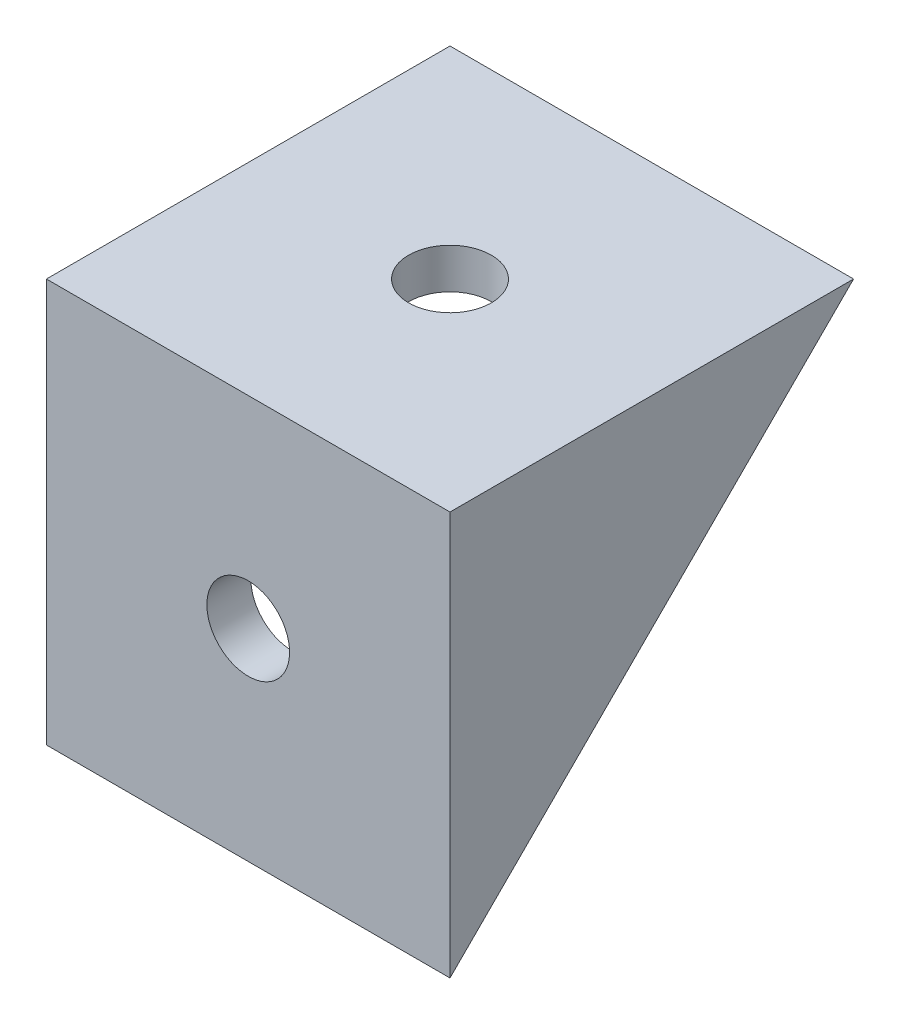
ISO-10303-21;
HEADER;
FILE_DESCRIPTION(('STEP AP214'),'2;1');
FILE_NAME('part.step','',(''),(''),'','','');
FILE_SCHEMA(('AUTOMOTIVE_DESIGN { 1 0 10303 214 1 1 1 1 }'));
ENDSEC;
DATA;
#1=APPLICATION_CONTEXT('core data for automotive mechanical design processes');
#2=APPLICATION_PROTOCOL_DEFINITION('international standard','automotive_design',2000,#1);
#3=PRODUCT_CONTEXT('',#1,'mechanical');
#4=PRODUCT('Part','Part','',(#3));
#5=PRODUCT_RELATED_PRODUCT_CATEGORY('part','',(#4));
#6=PRODUCT_DEFINITION_FORMATION('','',#4);
#7=PRODUCT_DEFINITION_CONTEXT('part definition',#1,'design');
#8=PRODUCT_DEFINITION('design','',#6,#7);
#9=PRODUCT_DEFINITION_SHAPE('','',#8);
#10=(LENGTH_UNIT() NAMED_UNIT(*) SI_UNIT(.MILLI.,.METRE.));
#11=(NAMED_UNIT(*) PLANE_ANGLE_UNIT() SI_UNIT($,.RADIAN.));
#12=(NAMED_UNIT(*) SI_UNIT($,.STERADIAN.) SOLID_ANGLE_UNIT());
#13=UNCERTAINTY_MEASURE_WITH_UNIT(LENGTH_MEASURE(1.E-05),#10,'distance_accuracy_value','');
#14=(GEOMETRIC_REPRESENTATION_CONTEXT(3) GLOBAL_UNCERTAINTY_ASSIGNED_CONTEXT((#13)) GLOBAL_UNIT_ASSIGNED_CONTEXT((#10,
#11,#12)) REPRESENTATION_CONTEXT('',''));
#15=CARTESIAN_POINT('',(0.,0.,0.));
#16=DIRECTION('',(0.,0.,1.));
#17=DIRECTION('',(1.,0.,0.));
#18=AXIS2_PLACEMENT_3D('',#15,#16,#17);
#19=CARTESIAN_POINT('',(20.,0.,-40.));
#20=DIRECTION('',(0.,0.707106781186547,0.707106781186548));
#21=DIRECTION('',(0.,-0.707106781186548,0.707106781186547));
#22=AXIS2_PLACEMENT_3D('',#19,#20,#21);
#23=PLANE('',#22);
#24=DIRECTION('',(0.,0.707106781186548,-0.707106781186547));
#25=VECTOR('',#24,1.);
#26=CARTESIAN_POINT('',(-20.,0.,-40.));
#27=LINE('',#26,#25);
#28=CARTESIAN_POINT('',(-20.,-40.,0.));
#29=VERTEX_POINT('',#28);
#30=CARTESIAN_POINT('',(-20.,0.,-40.));
#31=VERTEX_POINT('',#30);
#32=EDGE_CURVE('E130',#29,#31,#27,.T.);
#33=ORIENTED_EDGE('',*,*,#32,.T.);
#34=DIRECTION('',(-1.,0.,0.));
#35=VECTOR('',#34,1.);
#36=CARTESIAN_POINT('',(20.,0.,-40.));
#37=LINE('',#36,#35);
#38=CARTESIAN_POINT('',(20.,0.,-40.));
#39=VERTEX_POINT('',#38);
#40=EDGE_CURVE('E134',#39,#31,#37,.T.);
#41=ORIENTED_EDGE('',*,*,#40,.F.);
#42=DIRECTION('',(0.,0.707106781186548,-0.707106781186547));
#43=VECTOR('',#42,1.);
#44=CARTESIAN_POINT('',(20.,0.,-40.));
#45=LINE('',#44,#43);
#46=CARTESIAN_POINT('',(20.,-40.,0.));
#47=VERTEX_POINT('',#46);
#48=EDGE_CURVE('E82',#47,#39,#45,.T.);
#49=ORIENTED_EDGE('',*,*,#48,.F.);
#50=DIRECTION('',(-1.,0.,0.));
#51=VECTOR('',#50,1.);
#52=CARTESIAN_POINT('',(20.,-40.,0.));
#53=LINE('',#52,#51);
#54=EDGE_CURVE('E136',#47,#29,#53,.T.);
#55=ORIENTED_EDGE('',*,*,#54,.T.);
#56=EDGE_LOOP('',(#33,#41,#49,#55));
#57=FACE_BOUND('',#56,.T.);
#58=DIRECTION('',(0.,0.707106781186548,-0.707106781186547));
#59=VECTOR('',#58,1.);
#60=CARTESIAN_POINT('',(-15.,0.,-40.));
#61=LINE('',#60,#59);
#62=CARTESIAN_POINT('',(-15.,-35.6369103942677,-4.36308960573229));
#63=VERTEX_POINT('',#62);
#64=CARTESIAN_POINT('',(-15.,-4.,-36.));
#65=VERTEX_POINT('',#64);
#66=EDGE_CURVE('E11',#63,#65,#61,.T.);
#67=ORIENTED_EDGE('',*,*,#66,.F.);
#68=DIRECTION('',(1.,0.,0.));
#69=VECTOR('',#68,1.);
#70=CARTESIAN_POINT('',(20.,-35.6369103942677,-4.36308960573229));
#71=LINE('',#70,#69);
#72=CARTESIAN_POINT('',(15.,-35.6369103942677,-4.36308960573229));
#73=VERTEX_POINT('',#72);
#74=EDGE_CURVE('E43',#63,#73,#71,.T.);
#75=ORIENTED_EDGE('',*,*,#74,.T.);
#76=DIRECTION('',(0.,0.707106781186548,-0.707106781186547));
#77=VECTOR('',#76,1.);
#78=CARTESIAN_POINT('',(15.,0.,-40.));
#79=LINE('',#78,#77);
#80=CARTESIAN_POINT('',(15.,-4.,-36.));
#81=VERTEX_POINT('',#80);
#82=EDGE_CURVE('E138',#73,#81,#79,.T.);
#83=ORIENTED_EDGE('',*,*,#82,.T.);
#84=DIRECTION('',(-1.,0.,0.));
#85=VECTOR('',#84,1.);
#86=CARTESIAN_POINT('',(20.,-4.,-36.));
#87=LINE('',#86,#85);
#88=EDGE_CURVE('E141',#81,#65,#87,.T.);
#89=ORIENTED_EDGE('',*,*,#88,.T.);
#90=EDGE_LOOP('',(#67,#75,#83,#89));
#91=FACE_BOUND('',#90,.T.);
#92=ADVANCED_FACE('F35',(#57,#91),#23,.F.);
#93=CARTESIAN_POINT('',(20.,0.,0.));
#94=DIRECTION('',(0.,0.,-1.));
#95=DIRECTION('',(0.,1.,0.));
#96=AXIS2_PLACEMENT_3D('',#93,#94,#95);
#97=PLANE('',#96);
#98=CARTESIAN_POINT('',(0.,-20.,0.));
#99=DIRECTION('',(0.,0.,-1.));
#100=DIRECTION('',(0.,1.,0.));
#101=AXIS2_PLACEMENT_3D('',#98,#99,#100);
#102=CIRCLE('',#101,4.1);
#103=CARTESIAN_POINT('',(0.,-15.9,0.));
#104=VERTEX_POINT('',#103);
#105=EDGE_CURVE('E119',#104,#104,#102,.T.);
#106=ORIENTED_EDGE('',*,*,#105,.T.);
#107=EDGE_LOOP('',(#106));
#108=FACE_BOUND('',#107,.T.);
#109=DIRECTION('',(0.,-1.,0.));
#110=VECTOR('',#109,1.);
#111=CARTESIAN_POINT('',(-20.,0.,0.));
#112=LINE('',#111,#110);
#113=CARTESIAN_POINT('',(-20.,0.,0.));
#114=VERTEX_POINT('',#113);
#115=EDGE_CURVE('E111',#114,#29,#112,.T.);
#116=ORIENTED_EDGE('',*,*,#115,.T.);
#117=ORIENTED_EDGE('',*,*,#54,.F.);
#118=DIRECTION('',(0.,-1.,0.));
#119=VECTOR('',#118,1.);
#120=CARTESIAN_POINT('',(20.,0.,0.));
#121=LINE('',#120,#119);
#122=CARTESIAN_POINT('',(20.,0.,0.));
#123=VERTEX_POINT('',#122);
#124=EDGE_CURVE('E123',#123,#47,#121,.T.);
#125=ORIENTED_EDGE('',*,*,#124,.F.);
#126=DIRECTION('',(-1.,0.,0.));
#127=VECTOR('',#126,1.);
#128=CARTESIAN_POINT('',(20.,0.,0.));
#129=LINE('',#128,#127);
#130=EDGE_CURVE('E127',#123,#114,#129,.T.);
#131=ORIENTED_EDGE('',*,*,#130,.T.);
#132=EDGE_LOOP('',(#116,#117,#125,#131));
#133=FACE_BOUND('',#132,.T.);
#134=ADVANCED_FACE('F37',(#108,#133),#97,.F.);
#135=CARTESIAN_POINT('',(20.,0.,0.));
#136=DIRECTION('',(0.,-1.,0.));
#137=DIRECTION('',(0.,0.,-1.));
#138=AXIS2_PLACEMENT_3D('',#135,#136,#137);
#139=PLANE('',#138);
#140=CARTESIAN_POINT('',(0.,0.,-20.));
#141=DIRECTION('',(0.,-1.,0.));
#142=DIRECTION('',(0.,0.,-1.));
#143=AXIS2_PLACEMENT_3D('',#140,#141,#142);
#144=CIRCLE('',#143,4.1);
#145=CARTESIAN_POINT('',(0.,0.,-24.1));
#146=VERTEX_POINT('',#145);
#147=EDGE_CURVE('E183',#146,#146,#144,.T.);
#148=ORIENTED_EDGE('',*,*,#147,.T.);
#149=EDGE_LOOP('',(#148));
#150=FACE_BOUND('',#149,.T.);
#151=DIRECTION('',(0.,0.,1.));
#152=VECTOR('',#151,1.);
#153=CARTESIAN_POINT('',(-20.,0.,0.));
#154=LINE('',#153,#152);
#155=EDGE_CURVE('E76',#31,#114,#154,.T.);
#156=ORIENTED_EDGE('',*,*,#155,.T.);
#157=ORIENTED_EDGE('',*,*,#130,.F.);
#158=DIRECTION('',(0.,0.,1.));
#159=VECTOR('',#158,1.);
#160=CARTESIAN_POINT('',(20.,0.,0.));
#161=LINE('',#160,#159);
#162=EDGE_CURVE('E59',#39,#123,#161,.T.);
#163=ORIENTED_EDGE('',*,*,#162,.F.);
#164=ORIENTED_EDGE('',*,*,#40,.T.);
#165=EDGE_LOOP('',(#156,#157,#163,#164));
#166=FACE_BOUND('',#165,.T.);
#167=ADVANCED_FACE('F160',(#150,#166),#139,.F.);
#168=CARTESIAN_POINT('',(20.,0.,0.));
#169=DIRECTION('',(1.,0.,0.));
#170=DIRECTION('',(0.,0.,-1.));
#171=AXIS2_PLACEMENT_3D('',#168,#169,#170);
#172=PLANE('',#171);
#173=ORIENTED_EDGE('',*,*,#124,.T.);
#174=ORIENTED_EDGE('',*,*,#48,.T.);
#175=ORIENTED_EDGE('',*,*,#162,.T.);
#176=EDGE_LOOP('',(#173,#174,#175));
#177=FACE_BOUND('',#176,.T.);
#178=ADVANCED_FACE('F165',(#177),#172,.T.);
#179=CARTESIAN_POINT('',(-20.,0.,0.));
#180=DIRECTION('',(1.,0.,0.));
#181=DIRECTION('',(0.,0.,-1.));
#182=AXIS2_PLACEMENT_3D('',#179,#180,#181);
#183=PLANE('',#182);
#184=ORIENTED_EDGE('',*,*,#115,.F.);
#185=ORIENTED_EDGE('',*,*,#155,.F.);
#186=ORIENTED_EDGE('',*,*,#32,.F.);
#187=EDGE_LOOP('',(#184,#185,#186));
#188=FACE_BOUND('',#187,.T.);
#189=ADVANCED_FACE('F167',(#188),#183,.F.);
#190=CARTESIAN_POINT('',(-15.,-4.,-4.36308960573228));
#191=DIRECTION('',(0.,0.,1.));
#192=DIRECTION('',(0.,-1.,0.));
#193=AXIS2_PLACEMENT_3D('',#190,#191,#192);
#194=PLANE('',#193);
#195=CARTESIAN_POINT('',(0.,-20.,-4.36308960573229));
#196=DIRECTION('',(0.,0.,-1.));
#197=DIRECTION('',(0.,1.,0.));
#198=AXIS2_PLACEMENT_3D('',#195,#196,#197);
#199=CIRCLE('',#198,4.1);
#200=CARTESIAN_POINT('',(0.,-15.9,-4.36308960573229));
#201=VERTEX_POINT('',#200);
#202=EDGE_CURVE('E186',#201,#201,#199,.T.);
#203=ORIENTED_EDGE('',*,*,#202,.F.);
#204=EDGE_LOOP('',(#203));
#205=FACE_BOUND('',#204,.T.);
#206=DIRECTION('',(0.,-1.,0.));
#207=VECTOR('',#206,1.);
#208=CARTESIAN_POINT('',(-15.,-4.,-4.36308960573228));
#209=LINE('',#208,#207);
#210=CARTESIAN_POINT('',(-15.,-4.,-4.36308960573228));
#211=VERTEX_POINT('',#210);
#212=EDGE_CURVE('E101',#211,#63,#209,.T.);
#213=ORIENTED_EDGE('',*,*,#212,.F.);
#214=DIRECTION('',(1.,0.,0.));
#215=VECTOR('',#214,1.);
#216=CARTESIAN_POINT('',(-15.,-4.,-4.36308960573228));
#217=LINE('',#216,#215);
#218=CARTESIAN_POINT('',(15.,-4.,-4.36308960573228));
#219=VERTEX_POINT('',#218);
#220=EDGE_CURVE('E105',#211,#219,#217,.T.);
#221=ORIENTED_EDGE('',*,*,#220,.T.);
#222=DIRECTION('',(0.,-1.,0.));
#223=VECTOR('',#222,1.);
#224=CARTESIAN_POINT('',(15.,-4.,-4.36308960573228));
#225=LINE('',#224,#223);
#226=EDGE_CURVE('E116',#219,#73,#225,.T.);
#227=ORIENTED_EDGE('',*,*,#226,.T.);
#228=ORIENTED_EDGE('',*,*,#74,.F.);
#229=EDGE_LOOP('',(#213,#221,#227,#228));
#230=FACE_BOUND('',#229,.T.);
#231=ADVANCED_FACE('F113',(#205,#230),#194,.F.);
#232=CARTESIAN_POINT('',(-15.,-4.,-4.36308960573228));
#233=DIRECTION('',(0.,1.,0.));
#234=DIRECTION('',(0.,0.,1.));
#235=AXIS2_PLACEMENT_3D('',#232,#233,#234);
#236=PLANE('',#235);
#237=CARTESIAN_POINT('',(0.,-4.,-20.));
#238=DIRECTION('',(0.,-1.,0.));
#239=DIRECTION('',(0.,0.,-1.));
#240=AXIS2_PLACEMENT_3D('',#237,#238,#239);
#241=CIRCLE('',#240,4.1);
#242=CARTESIAN_POINT('',(0.,-4.,-24.1));
#243=VERTEX_POINT('',#242);
#244=EDGE_CURVE('E181',#243,#243,#241,.T.);
#245=ORIENTED_EDGE('',*,*,#244,.F.);
#246=EDGE_LOOP('',(#245));
#247=FACE_BOUND('',#246,.T.);
#248=DIRECTION('',(0.,0.,1.));
#249=VECTOR('',#248,1.);
#250=CARTESIAN_POINT('',(15.,-4.,-4.36308960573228));
#251=LINE('',#250,#249);
#252=EDGE_CURVE('E50',#81,#219,#251,.T.);
#253=ORIENTED_EDGE('',*,*,#252,.T.);
#254=ORIENTED_EDGE('',*,*,#220,.F.);
#255=DIRECTION('',(0.,0.,1.));
#256=VECTOR('',#255,1.);
#257=CARTESIAN_POINT('',(-15.,-4.,-4.36308960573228));
#258=LINE('',#257,#256);
#259=EDGE_CURVE('E97',#65,#211,#258,.T.);
#260=ORIENTED_EDGE('',*,*,#259,.F.);
#261=ORIENTED_EDGE('',*,*,#88,.F.);
#262=EDGE_LOOP('',(#253,#254,#260,#261));
#263=FACE_BOUND('',#262,.T.);
#264=ADVANCED_FACE('F108',(#247,#263),#236,.F.);
#265=CARTESIAN_POINT('',(-15.,0.,0.));
#266=DIRECTION('',(1.,0.,0.));
#267=DIRECTION('',(0.,0.,-1.));
#268=AXIS2_PLACEMENT_3D('',#265,#266,#267);
#269=PLANE('',#268);
#270=ORIENTED_EDGE('',*,*,#66,.T.);
#271=ORIENTED_EDGE('',*,*,#259,.T.);
#272=ORIENTED_EDGE('',*,*,#212,.T.);
#273=EDGE_LOOP('',(#270,#271,#272));
#274=FACE_BOUND('',#273,.T.);
#275=ADVANCED_FACE('F99',(#274),#269,.T.);
#276=CARTESIAN_POINT('',(15.,0.,0.));
#277=DIRECTION('',(1.,0.,0.));
#278=DIRECTION('',(0.,0.,-1.));
#279=AXIS2_PLACEMENT_3D('',#276,#277,#278);
#280=PLANE('',#279);
#281=ORIENTED_EDGE('',*,*,#226,.F.);
#282=ORIENTED_EDGE('',*,*,#252,.F.);
#283=ORIENTED_EDGE('',*,*,#82,.F.);
#284=EDGE_LOOP('',(#281,#282,#283));
#285=FACE_BOUND('',#284,.T.);
#286=ADVANCED_FACE('F143',(#285),#280,.F.);
#287=CARTESIAN_POINT('',(0.,-20.,25.6369103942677));
#288=DIRECTION('',(0.,0.,-1.));
#289=DIRECTION('',(0.,1.,0.));
#290=AXIS2_PLACEMENT_3D('',#287,#288,#289);
#291=CYLINDRICAL_SURFACE('',#290,4.1);
#292=ORIENTED_EDGE('',*,*,#202,.T.);
#293=EDGE_LOOP('',(#292));
#294=FACE_BOUND('',#293,.T.);
#295=ORIENTED_EDGE('',*,*,#105,.F.);
#296=EDGE_LOOP('',(#295));
#297=FACE_BOUND('',#296,.T.);
#298=ADVANCED_FACE('F145',(#294,#297),#291,.F.);
#299=CARTESIAN_POINT('',(0.,26.,-20.));
#300=DIRECTION('',(0.,-1.,0.));
#301=DIRECTION('',(0.,0.,-1.));
#302=AXIS2_PLACEMENT_3D('',#299,#300,#301);
#303=CYLINDRICAL_SURFACE('',#302,4.1);
#304=ORIENTED_EDGE('',*,*,#244,.T.);
#305=EDGE_LOOP('',(#304));
#306=FACE_BOUND('',#305,.T.);
#307=ORIENTED_EDGE('',*,*,#147,.F.);
#308=EDGE_LOOP('',(#307));
#309=FACE_BOUND('',#308,.T.);
#310=ADVANCED_FACE('F151',(#306,#309),#303,.F.);
#311=CLOSED_SHELL('',(#92,#134,#167,#178,#189,#231,#264,#275,#286,#298,#310));
#312=MANIFOLD_SOLID_BREP('B2',#311);
#313=ADVANCED_BREP_SHAPE_REPRESENTATION('',(#18,#312),#14);
#314=SHAPE_DEFINITION_REPRESENTATION(#9,#313);
ENDSEC;
END-ISO-10303-21;
